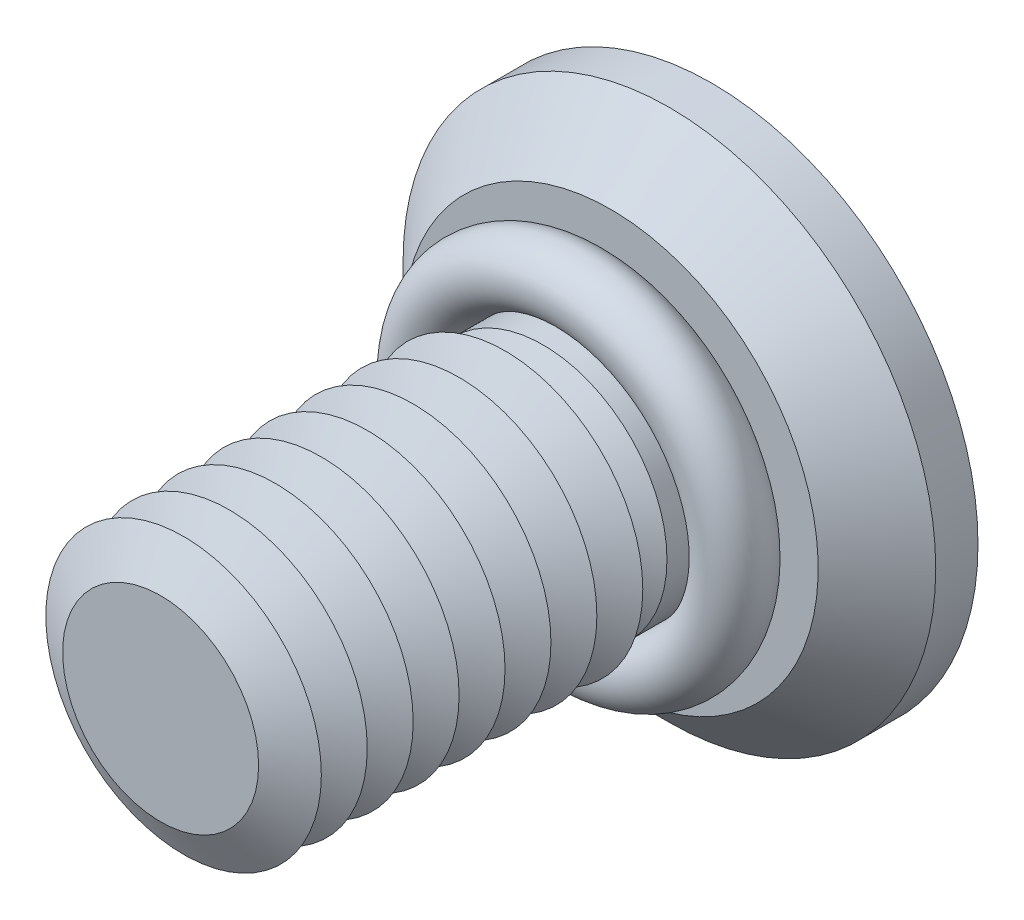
ISO-10303-21;
HEADER;
FILE_DESCRIPTION(('STEP AP214'),'2;1');
FILE_NAME('part.step','',(''),(''),'','','');
FILE_SCHEMA(('AUTOMOTIVE_DESIGN { 1 0 10303 214 1 1 1 1 }'));
ENDSEC;
DATA;
#1=APPLICATION_CONTEXT('core data for automotive mechanical design processes');
#2=APPLICATION_PROTOCOL_DEFINITION('international standard','automotive_design',2000,#1);
#3=PRODUCT_CONTEXT('',#1,'mechanical');
#4=PRODUCT('Part','Part','',(#3));
#5=PRODUCT_RELATED_PRODUCT_CATEGORY('part','',(#4));
#6=PRODUCT_DEFINITION_FORMATION('','',#4);
#7=PRODUCT_DEFINITION_CONTEXT('part definition',#1,'design');
#8=PRODUCT_DEFINITION('design','',#6,#7);
#9=PRODUCT_DEFINITION_SHAPE('','',#8);
#10=(LENGTH_UNIT() NAMED_UNIT(*) SI_UNIT(.MILLI.,.METRE.));
#11=(NAMED_UNIT(*) PLANE_ANGLE_UNIT() SI_UNIT($,.RADIAN.));
#12=(NAMED_UNIT(*) SI_UNIT($,.STERADIAN.) SOLID_ANGLE_UNIT());
#13=UNCERTAINTY_MEASURE_WITH_UNIT(LENGTH_MEASURE(1.E-05),#10,'distance_accuracy_value','');
#14=(GEOMETRIC_REPRESENTATION_CONTEXT(3) GLOBAL_UNCERTAINTY_ASSIGNED_CONTEXT((#13)) GLOBAL_UNIT_ASSIGNED_CONTEXT((#10,
#11,#12)) REPRESENTATION_CONTEXT('',''));
#15=CARTESIAN_POINT('',(0.,0.,0.));
#16=DIRECTION('',(0.,0.,1.));
#17=DIRECTION('',(1.,0.,0.));
#18=AXIS2_PLACEMENT_3D('',#15,#16,#17);
#19=CARTESIAN_POINT('',(0.,0.,1.45000000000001));
#20=DIRECTION('',(0.,0.,1.));
#21=DIRECTION('',(1.,0.,0.));
#22=AXIS2_PLACEMENT_3D('',#19,#20,#21);
#23=TOROIDAL_SURFACE('',#22,1.7,0.35);
#24=CARTESIAN_POINT('',(0.,1.7,1.45000000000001));
#25=DIRECTION('',(1.,0.,0.));
#26=DIRECTION('',(0.,0.,-1.));
#27=AXIS2_PLACEMENT_3D('',#24,#25,#26);
#28=CIRCLE('',#27,0.35);
#29=CARTESIAN_POINT('',(0.,2.05,1.45000000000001));
#30=VERTEX_POINT('',#29);
#31=EDGE_CURVE('P0_E10',#30,#30,#28,.T.);
#32=CARTESIAN_POINT('',(0.,0.,1.45000000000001));
#33=DIRECTION('',(0.,0.,1.));
#34=DIRECTION('',(1.,0.,0.));
#35=AXIS2_PLACEMENT_3D('',#32,#33,#34);
#36=CIRCLE('',#35,2.05);
#37=EDGE_CURVE('',#30,#30,#36,.T.);
#38=ORIENTED_EDGE('',*,*,#31,.F.);
#39=ORIENTED_EDGE('',*,*,#31,.T.);
#40=ORIENTED_EDGE('',*,*,#37,.T.);
#41=ORIENTED_EDGE('',*,*,#37,.F.);
#42=EDGE_LOOP('',(#38,#40,#39,#41));
#43=FACE_BOUND('',#42,.T.);
#44=ADVANCED_FACE('P0_F14',(#43),#23,.T.);
#45=CLOSED_SHELL('',(#44));
#46=MANIFOLD_SOLID_BREP('P0_B1',#45);
#47=CARTESIAN_POINT('',(0.,0.,3.5));
#48=DIRECTION('',(0.,0.,-1.));
#49=DIRECTION('',(-1.,0.,0.));
#50=AXIS2_PLACEMENT_3D('',#47,#48,#49);
#51=CONICAL_SURFACE('',#50,1.06698729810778,1.0471975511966);
#52=CARTESIAN_POINT('',(0.,0.,3.25));
#53=DIRECTION('',(0.,0.,1.));
#54=DIRECTION('',(1.,0.,0.));
#55=AXIS2_PLACEMENT_3D('',#52,#53,#54);
#56=CIRCLE('',#55,1.5);
#57=CARTESIAN_POINT('',(1.5,0.,3.25));
#58=VERTEX_POINT('',#57);
#59=EDGE_CURVE('P1_E324',#58,#58,#56,.T.);
#60=ORIENTED_EDGE('',*,*,#59,.T.);
#61=EDGE_LOOP('',(#60));
#62=FACE_BOUND('',#61,.T.);
#63=CARTESIAN_POINT('',(0.,0.,3.5));
#64=DIRECTION('',(0.,0.,1.));
#65=DIRECTION('',(1.,0.,0.));
#66=AXIS2_PLACEMENT_3D('',#63,#64,#65);
#67=CIRCLE('',#66,1.06698729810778);
#68=CARTESIAN_POINT('',(1.06698729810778,0.,3.5));
#69=VERTEX_POINT('',#68);
#70=EDGE_CURVE('P1_E321',#69,#69,#67,.T.);
#71=ORIENTED_EDGE('',*,*,#70,.F.);
#72=EDGE_LOOP('',(#71));
#73=FACE_BOUND('',#72,.T.);
#74=ADVANCED_FACE('P1_F15',(#62,#73),#51,.T.);
#75=CARTESIAN_POINT('',(0.,0.,3.75));
#76=DIRECTION('',(0.,0.,1.));
#77=DIRECTION('',(1.,0.,0.));
#78=AXIS2_PLACEMENT_3D('',#75,#76,#77);
#79=CONICAL_SURFACE('',#78,1.5,1.0471975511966);
#80=ORIENTED_EDGE('',*,*,#70,.T.);
#81=EDGE_LOOP('',(#80));
#82=FACE_BOUND('',#81,.T.);
#83=CARTESIAN_POINT('',(0.,0.,3.75));
#84=DIRECTION('',(0.,0.,1.));
#85=DIRECTION('',(1.,0.,0.));
#86=AXIS2_PLACEMENT_3D('',#83,#84,#85);
#87=CIRCLE('',#86,1.5);
#88=CARTESIAN_POINT('',(1.5,0.,3.75));
#89=VERTEX_POINT('',#88);
#90=EDGE_CURVE('P1_E318',#89,#89,#87,.T.);
#91=ORIENTED_EDGE('',*,*,#90,.F.);
#92=EDGE_LOOP('',(#91));
#93=FACE_BOUND('',#92,.T.);
#94=ADVANCED_FACE('P1_F245',(#82,#93),#79,.T.);
#95=CARTESIAN_POINT('',(0.,0.,6.));
#96=DIRECTION('',(0.,0.,1.));
#97=DIRECTION('',(1.,0.,0.));
#98=AXIS2_PLACEMENT_3D('',#95,#96,#97);
#99=PLANE('',#98);
#100=CARTESIAN_POINT('',(0.,0.,6.));
#101=DIRECTION('',(0.,0.,1.));
#102=DIRECTION('',(1.,0.,0.));
#103=AXIS2_PLACEMENT_3D('',#100,#101,#102);
#104=CIRCLE('',#103,1.06698729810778);
#105=CARTESIAN_POINT('',(1.06698729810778,0.,6.));
#106=VERTEX_POINT('',#105);
#107=EDGE_CURVE('P1_E131',#106,#106,#104,.T.);
#108=ORIENTED_EDGE('',*,*,#107,.T.);
#109=EDGE_LOOP('',(#108));
#110=FACE_BOUND('',#109,.T.);
#111=ADVANCED_FACE('P1_F251',(#110),#99,.T.);
#112=CARTESIAN_POINT('',(0.,0.,6.));
#113=DIRECTION('',(0.,0.,-1.));
#114=DIRECTION('',(-1.,0.,0.));
#115=AXIS2_PLACEMENT_3D('',#112,#113,#114);
#116=CONICAL_SURFACE('',#115,1.06698729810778,1.0471975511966);
#117=CARTESIAN_POINT('',(0.,0.,5.75));
#118=DIRECTION('',(0.,0.,1.));
#119=DIRECTION('',(1.,0.,0.));
#120=AXIS2_PLACEMENT_3D('',#117,#118,#119);
#121=CIRCLE('',#120,1.5);
#122=CARTESIAN_POINT('',(1.5,0.,5.75));
#123=VERTEX_POINT('',#122);
#124=EDGE_CURVE('P1_E133',#123,#123,#121,.T.);
#125=ORIENTED_EDGE('',*,*,#124,.T.);
#126=EDGE_LOOP('',(#125));
#127=FACE_BOUND('',#126,.T.);
#128=ORIENTED_EDGE('',*,*,#107,.F.);
#129=EDGE_LOOP('',(#128));
#130=FACE_BOUND('',#129,.T.);
#131=ADVANCED_FACE('P1_F196',(#127,#130),#116,.T.);
#132=CARTESIAN_POINT('',(0.,0.,5.75));
#133=DIRECTION('',(0.,0.,1.));
#134=DIRECTION('',(1.,0.,0.));
#135=AXIS2_PLACEMENT_3D('',#132,#133,#134);
#136=CONICAL_SURFACE('',#135,1.5,1.0471975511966);
#137=CARTESIAN_POINT('',(0.,0.,5.5));
#138=DIRECTION('',(0.,0.,1.));
#139=DIRECTION('',(1.,0.,0.));
#140=AXIS2_PLACEMENT_3D('',#137,#138,#139);
#141=CIRCLE('',#140,1.06698729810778);
#142=CARTESIAN_POINT('',(1.06698729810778,0.,5.5));
#143=VERTEX_POINT('',#142);
#144=EDGE_CURVE('P1_E297',#143,#143,#141,.T.);
#145=ORIENTED_EDGE('',*,*,#144,.T.);
#146=EDGE_LOOP('',(#145));
#147=FACE_BOUND('',#146,.T.);
#148=ORIENTED_EDGE('',*,*,#124,.F.);
#149=EDGE_LOOP('',(#148));
#150=FACE_BOUND('',#149,.T.);
#151=ADVANCED_FACE('P1_F284',(#147,#150),#136,.T.);
#152=CARTESIAN_POINT('',(0.,0.,5.5));
#153=DIRECTION('',(0.,0.,-1.));
#154=DIRECTION('',(-1.,0.,0.));
#155=AXIS2_PLACEMENT_3D('',#152,#153,#154);
#156=CONICAL_SURFACE('',#155,1.06698729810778,1.0471975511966);
#157=CARTESIAN_POINT('',(0.,0.,5.25));
#158=DIRECTION('',(0.,0.,1.));
#159=DIRECTION('',(1.,0.,0.));
#160=AXIS2_PLACEMENT_3D('',#157,#158,#159);
#161=CIRCLE('',#160,1.5);
#162=CARTESIAN_POINT('',(1.5,0.,5.25));
#163=VERTEX_POINT('',#162);
#164=EDGE_CURVE('P1_E294',#163,#163,#161,.T.);
#165=ORIENTED_EDGE('',*,*,#164,.T.);
#166=EDGE_LOOP('',(#165));
#167=FACE_BOUND('',#166,.T.);
#168=ORIENTED_EDGE('',*,*,#144,.F.);
#169=EDGE_LOOP('',(#168));
#170=FACE_BOUND('',#169,.T.);
#171=ADVANCED_FACE('P1_F279',(#167,#170),#156,.T.);
#172=CARTESIAN_POINT('',(0.,0.,5.25));
#173=DIRECTION('',(0.,0.,1.));
#174=DIRECTION('',(1.,0.,0.));
#175=AXIS2_PLACEMENT_3D('',#172,#173,#174);
#176=CONICAL_SURFACE('',#175,1.5,1.0471975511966);
#177=CARTESIAN_POINT('',(0.,0.,5.));
#178=DIRECTION('',(0.,0.,1.));
#179=DIRECTION('',(1.,0.,0.));
#180=AXIS2_PLACEMENT_3D('',#177,#178,#179);
#181=CIRCLE('',#180,1.06698729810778);
#182=CARTESIAN_POINT('',(1.06698729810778,0.,5.));
#183=VERTEX_POINT('',#182);
#184=EDGE_CURVE('P1_E301',#183,#183,#181,.T.);
#185=ORIENTED_EDGE('',*,*,#184,.T.);
#186=EDGE_LOOP('',(#185));
#187=FACE_BOUND('',#186,.T.);
#188=ORIENTED_EDGE('',*,*,#164,.F.);
#189=EDGE_LOOP('',(#188));
#190=FACE_BOUND('',#189,.T.);
#191=ADVANCED_FACE('P1_F276',(#187,#190),#176,.T.);
#192=CARTESIAN_POINT('',(0.,0.,5.));
#193=DIRECTION('',(0.,0.,-1.));
#194=DIRECTION('',(-1.,0.,0.));
#195=AXIS2_PLACEMENT_3D('',#192,#193,#194);
#196=CONICAL_SURFACE('',#195,1.06698729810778,1.0471975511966);
#197=CARTESIAN_POINT('',(0.,0.,4.75));
#198=DIRECTION('',(0.,0.,1.));
#199=DIRECTION('',(1.,0.,0.));
#200=AXIS2_PLACEMENT_3D('',#197,#198,#199);
#201=CIRCLE('',#200,1.5);
#202=CARTESIAN_POINT('',(1.5,0.,4.75));
#203=VERTEX_POINT('',#202);
#204=EDGE_CURVE('P1_E306',#203,#203,#201,.T.);
#205=ORIENTED_EDGE('',*,*,#204,.T.);
#206=EDGE_LOOP('',(#205));
#207=FACE_BOUND('',#206,.T.);
#208=ORIENTED_EDGE('',*,*,#184,.F.);
#209=EDGE_LOOP('',(#208));
#210=FACE_BOUND('',#209,.T.);
#211=ADVANCED_FACE('P1_F271',(#207,#210),#196,.T.);
#212=CARTESIAN_POINT('',(0.,0.,4.75));
#213=DIRECTION('',(0.,0.,1.));
#214=DIRECTION('',(1.,0.,0.));
#215=AXIS2_PLACEMENT_3D('',#212,#213,#214);
#216=CONICAL_SURFACE('',#215,1.5,1.0471975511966);
#217=CARTESIAN_POINT('',(0.,0.,4.5));
#218=DIRECTION('',(0.,0.,1.));
#219=DIRECTION('',(1.,0.,0.));
#220=AXIS2_PLACEMENT_3D('',#217,#218,#219);
#221=CIRCLE('',#220,1.06698729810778);
#222=CARTESIAN_POINT('',(1.06698729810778,0.,4.5));
#223=VERTEX_POINT('',#222);
#224=EDGE_CURVE('P1_E309',#223,#223,#221,.T.);
#225=ORIENTED_EDGE('',*,*,#224,.T.);
#226=EDGE_LOOP('',(#225));
#227=FACE_BOUND('',#226,.T.);
#228=ORIENTED_EDGE('',*,*,#204,.F.);
#229=EDGE_LOOP('',(#228));
#230=FACE_BOUND('',#229,.T.);
#231=ADVANCED_FACE('P1_F268',(#227,#230),#216,.T.);
#232=CARTESIAN_POINT('',(0.,0.,4.5));
#233=DIRECTION('',(0.,0.,-1.));
#234=DIRECTION('',(-1.,0.,0.));
#235=AXIS2_PLACEMENT_3D('',#232,#233,#234);
#236=CONICAL_SURFACE('',#235,1.06698729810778,1.0471975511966);
#237=CARTESIAN_POINT('',(0.,0.,4.25));
#238=DIRECTION('',(0.,0.,1.));
#239=DIRECTION('',(1.,0.,0.));
#240=AXIS2_PLACEMENT_3D('',#237,#238,#239);
#241=CIRCLE('',#240,1.5);
#242=CARTESIAN_POINT('',(1.5,0.,4.25));
#243=VERTEX_POINT('',#242);
#244=EDGE_CURVE('P1_E312',#243,#243,#241,.T.);
#245=ORIENTED_EDGE('',*,*,#244,.T.);
#246=EDGE_LOOP('',(#245));
#247=FACE_BOUND('',#246,.T.);
#248=ORIENTED_EDGE('',*,*,#224,.F.);
#249=EDGE_LOOP('',(#248));
#250=FACE_BOUND('',#249,.T.);
#251=ADVANCED_FACE('P1_F262',(#247,#250),#236,.T.);
#252=CARTESIAN_POINT('',(0.,0.,4.25));
#253=DIRECTION('',(0.,0.,1.));
#254=DIRECTION('',(1.,0.,0.));
#255=AXIS2_PLACEMENT_3D('',#252,#253,#254);
#256=CONICAL_SURFACE('',#255,1.5,1.0471975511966);
#257=CARTESIAN_POINT('',(0.,0.,4.));
#258=DIRECTION('',(0.,0.,1.));
#259=DIRECTION('',(1.,0.,0.));
#260=AXIS2_PLACEMENT_3D('',#257,#258,#259);
#261=CIRCLE('',#260,1.06698729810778);
#262=CARTESIAN_POINT('',(1.06698729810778,0.,4.));
#263=VERTEX_POINT('',#262);
#264=EDGE_CURVE('P1_E315',#263,#263,#261,.T.);
#265=ORIENTED_EDGE('',*,*,#264,.T.);
#266=EDGE_LOOP('',(#265));
#267=FACE_BOUND('',#266,.T.);
#268=ORIENTED_EDGE('',*,*,#244,.F.);
#269=EDGE_LOOP('',(#268));
#270=FACE_BOUND('',#269,.T.);
#271=ADVANCED_FACE('P1_F258',(#267,#270),#256,.T.);
#272=CARTESIAN_POINT('',(0.,0.,4.));
#273=DIRECTION('',(0.,0.,-1.));
#274=DIRECTION('',(-1.,0.,0.));
#275=AXIS2_PLACEMENT_3D('',#272,#273,#274);
#276=CONICAL_SURFACE('',#275,1.06698729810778,1.0471975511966);
#277=ORIENTED_EDGE('',*,*,#90,.T.);
#278=EDGE_LOOP('',(#277));
#279=FACE_BOUND('',#278,.T.);
#280=ORIENTED_EDGE('',*,*,#264,.F.);
#281=EDGE_LOOP('',(#280));
#282=FACE_BOUND('',#281,.T.);
#283=ADVANCED_FACE('P1_F261',(#279,#282),#276,.T.);
#284=CARTESIAN_POINT('',(0.,0.,3.));
#285=DIRECTION('',(0.,0.,-1.));
#286=DIRECTION('',(-1.,0.,0.));
#287=AXIS2_PLACEMENT_3D('',#284,#285,#286);
#288=CONICAL_SURFACE('',#287,1.06698729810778,1.0471975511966);
#289=CARTESIAN_POINT('',(0.,0.,2.75));
#290=DIRECTION('',(0.,0.,1.));
#291=DIRECTION('',(1.,0.,0.));
#292=AXIS2_PLACEMENT_3D('',#289,#290,#291);
#293=CIRCLE('',#292,1.5);
#294=CARTESIAN_POINT('',(1.5,0.,2.75));
#295=VERTEX_POINT('',#294);
#296=EDGE_CURVE('P1_E329',#295,#295,#293,.T.);
#297=ORIENTED_EDGE('',*,*,#296,.T.);
#298=EDGE_LOOP('',(#297));
#299=FACE_BOUND('',#298,.T.);
#300=CARTESIAN_POINT('',(0.,0.,3.));
#301=DIRECTION('',(0.,0.,1.));
#302=DIRECTION('',(1.,0.,0.));
#303=AXIS2_PLACEMENT_3D('',#300,#301,#302);
#304=CIRCLE('',#303,1.06698729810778);
#305=CARTESIAN_POINT('',(1.06698729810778,0.,3.));
#306=VERTEX_POINT('',#305);
#307=EDGE_CURVE('P1_E326',#306,#306,#304,.T.);
#308=ORIENTED_EDGE('',*,*,#307,.F.);
#309=EDGE_LOOP('',(#308));
#310=FACE_BOUND('',#309,.T.);
#311=ADVANCED_FACE('P1_F266',(#299,#310),#288,.T.);
#312=CARTESIAN_POINT('',(0.,0.,3.25));
#313=DIRECTION('',(0.,0.,1.));
#314=DIRECTION('',(1.,0.,0.));
#315=AXIS2_PLACEMENT_3D('',#312,#313,#314);
#316=CONICAL_SURFACE('',#315,1.5,1.0471975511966);
#317=ORIENTED_EDGE('',*,*,#307,.T.);
#318=EDGE_LOOP('',(#317));
#319=FACE_BOUND('',#318,.T.);
#320=ORIENTED_EDGE('',*,*,#59,.F.);
#321=EDGE_LOOP('',(#320));
#322=FACE_BOUND('',#321,.T.);
#323=ADVANCED_FACE('P1_F443',(#319,#322),#316,.T.);
#324=CARTESIAN_POINT('',(0.,0.,2.5));
#325=DIRECTION('',(0.,0.,-1.));
#326=DIRECTION('',(-1.,0.,0.));
#327=AXIS2_PLACEMENT_3D('',#324,#325,#326);
#328=CONICAL_SURFACE('',#327,1.06698729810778,1.0471975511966);
#329=CARTESIAN_POINT('',(0.,0.,2.25));
#330=DIRECTION('',(0.,0.,1.));
#331=DIRECTION('',(1.,0.,0.));
#332=AXIS2_PLACEMENT_3D('',#329,#330,#331);
#333=CIRCLE('',#332,1.5);
#334=CARTESIAN_POINT('',(1.5,0.,2.25));
#335=VERTEX_POINT('',#334);
#336=EDGE_CURVE('P1_E335',#335,#335,#333,.T.);
#337=ORIENTED_EDGE('',*,*,#336,.T.);
#338=EDGE_LOOP('',(#337));
#339=FACE_BOUND('',#338,.T.);
#340=CARTESIAN_POINT('',(0.,0.,2.5));
#341=DIRECTION('',(0.,0.,1.));
#342=DIRECTION('',(1.,0.,0.));
#343=AXIS2_PLACEMENT_3D('',#340,#341,#342);
#344=CIRCLE('',#343,1.06698729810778);
#345=CARTESIAN_POINT('',(1.06698729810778,0.,2.5));
#346=VERTEX_POINT('',#345);
#347=EDGE_CURVE('P1_E332',#346,#346,#344,.T.);
#348=ORIENTED_EDGE('',*,*,#347,.F.);
#349=EDGE_LOOP('',(#348));
#350=FACE_BOUND('',#349,.T.);
#351=ADVANCED_FACE('P1_F453',(#339,#350),#328,.T.);
#352=CARTESIAN_POINT('',(0.,0.,2.75));
#353=DIRECTION('',(0.,0.,1.));
#354=DIRECTION('',(1.,0.,0.));
#355=AXIS2_PLACEMENT_3D('',#352,#353,#354);
#356=CONICAL_SURFACE('',#355,1.5,1.0471975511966);
#357=ORIENTED_EDGE('',*,*,#347,.T.);
#358=EDGE_LOOP('',(#357));
#359=FACE_BOUND('',#358,.T.);
#360=ORIENTED_EDGE('',*,*,#296,.F.);
#361=EDGE_LOOP('',(#360));
#362=FACE_BOUND('',#361,.T.);
#363=ADVANCED_FACE('P1_F348',(#359,#362),#356,.T.);
#364=CARTESIAN_POINT('',(0.,0.,2.));
#365=DIRECTION('',(0.,0.,-1.));
#366=DIRECTION('',(-1.,0.,0.));
#367=AXIS2_PLACEMENT_3D('',#364,#365,#366);
#368=CONICAL_SURFACE('',#367,1.06698729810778,1.0471975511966);
#369=CARTESIAN_POINT('',(0.,0.,2.));
#370=DIRECTION('',(0.,0.,1.));
#371=DIRECTION('',(1.,0.,0.));
#372=AXIS2_PLACEMENT_3D('',#369,#370,#371);
#373=CIRCLE('',#372,1.06698729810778);
#374=CARTESIAN_POINT('',(1.06698729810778,0.,2.));
#375=VERTEX_POINT('',#374);
#376=EDGE_CURVE('P1_E338',#375,#375,#373,.T.);
#377=ORIENTED_EDGE('',*,*,#376,.F.);
#378=EDGE_LOOP('',(#377));
#379=FACE_BOUND('',#378,.T.);
#380=CARTESIAN_POINT('',(0.,0.,1.83660254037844));
#381=DIRECTION('',(0.,0.,-1.));
#382=DIRECTION('',(-1.,0.,0.));
#383=AXIS2_PLACEMENT_3D('',#380,#381,#382);
#384=CIRCLE('',#383,1.35);
#385=CARTESIAN_POINT('',(-1.35,0.,1.83660254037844));
#386=VERTEX_POINT('',#385);
#387=EDGE_CURVE('P1_E19',#386,#386,#384,.F.);
#388=ORIENTED_EDGE('',*,*,#387,.T.);
#389=EDGE_LOOP('',(#388));
#390=FACE_BOUND('',#389,.T.);
#391=ADVANCED_FACE('P1_F345',(#379,#390),#368,.T.);
#392=CARTESIAN_POINT('',(0.,0.,2.25));
#393=DIRECTION('',(0.,0.,1.));
#394=DIRECTION('',(1.,0.,0.));
#395=AXIS2_PLACEMENT_3D('',#392,#393,#394);
#396=CONICAL_SURFACE('',#395,1.5,1.0471975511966);
#397=ORIENTED_EDGE('',*,*,#376,.T.);
#398=EDGE_LOOP('',(#397));
#399=FACE_BOUND('',#398,.T.);
#400=ORIENTED_EDGE('',*,*,#336,.F.);
#401=EDGE_LOOP('',(#400));
#402=FACE_BOUND('',#401,.T.);
#403=ADVANCED_FACE('P1_F342',(#399,#402),#396,.T.);
#404=CARTESIAN_POINT('',(0.,0.,1.2));
#405=DIRECTION('',(0.,0.,-1.));
#406=DIRECTION('',(-1.,0.,0.));
#407=AXIS2_PLACEMENT_3D('',#404,#405,#406);
#408=CONICAL_SURFACE('',#407,1.,1.0471975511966);
#409=CARTESIAN_POINT('',(0.,0.,1.77735026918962));
#410=VERTEX_POINT('',#409);
#411=VERTEX_LOOP('',#410);
#412=FACE_BOUND('',#411,.T.);
#413=CARTESIAN_POINT('',(0.,0.,1.2));
#414=DIRECTION('',(0.,0.,-1.));
#415=DIRECTION('',(-1.,0.,0.));
#416=AXIS2_PLACEMENT_3D('',#413,#414,#415);
#417=CIRCLE('',#416,1.);
#418=CARTESIAN_POINT('',(-1.,0.,1.2));
#419=VERTEX_POINT('',#418);
#420=CARTESIAN_POINT('',(-0.5,0.866025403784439,1.2));
#421=VERTEX_POINT('',#420);
#422=EDGE_CURVE('P1_E117',#419,#421,#417,.T.);
#423=ORIENTED_EDGE('',*,*,#422,.T.);
#424=CARTESIAN_POINT('',(0.,0.,1.2));
#425=DIRECTION('',(0.,0.,-1.));
#426=DIRECTION('',(-1.,0.,0.));
#427=AXIS2_PLACEMENT_3D('',#424,#425,#426);
#428=CIRCLE('',#427,1.);
#429=CARTESIAN_POINT('',(0.5,0.866025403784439,1.2));
#430=VERTEX_POINT('',#429);
#431=EDGE_CURVE('P1_E24',#421,#430,#428,.T.);
#432=ORIENTED_EDGE('',*,*,#431,.T.);
#433=CARTESIAN_POINT('',(1.,0.,1.2));
#434=VERTEX_POINT('',#433);
#435=EDGE_CURVE('P1_E687',#430,#434,#428,.T.);
#436=ORIENTED_EDGE('',*,*,#435,.T.);
#437=CARTESIAN_POINT('',(0.5,-0.866025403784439,1.2));
#438=VERTEX_POINT('',#437);
#439=EDGE_CURVE('P1_E680',#434,#438,#428,.T.);
#440=ORIENTED_EDGE('',*,*,#439,.T.);
#441=CARTESIAN_POINT('',(-0.499999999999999,-0.866025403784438,1.2));
#442=VERTEX_POINT('',#441);
#443=EDGE_CURVE('P1_E182',#438,#442,#428,.T.);
#444=ORIENTED_EDGE('',*,*,#443,.T.);
#445=EDGE_CURVE('P1_E179',#442,#419,#428,.T.);
#446=ORIENTED_EDGE('',*,*,#445,.T.);
#447=EDGE_LOOP('',(#423,#432,#436,#440,#444,#446));
#448=FACE_BOUND('',#447,.T.);
#449=ADVANCED_FACE('P1_F198',(#412,#448),#408,.F.);
#450=CARTESIAN_POINT('',(0.,0.,1.2));
#451=DIRECTION('',(0.,0.,-1.));
#452=DIRECTION('',(-1.,0.,0.));
#453=AXIS2_PLACEMENT_3D('',#450,#451,#452);
#454=PLANE('',#453);
#455=ORIENTED_EDGE('',*,*,#443,.F.);
#456=DIRECTION('',(-0.866025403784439,-0.5,0.));
#457=VECTOR('',#456,1.);
#458=CARTESIAN_POINT('',(1.,-0.577350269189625,1.2));
#459=LINE('',#458,#457);
#460=CARTESIAN_POINT('',(0.,-1.15470053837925,1.2));
#461=VERTEX_POINT('',#460);
#462=EDGE_CURVE('P1_E696',#438,#461,#459,.T.);
#463=ORIENTED_EDGE('',*,*,#462,.T.);
#464=DIRECTION('',(-0.866025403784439,0.5,0.));
#465=VECTOR('',#464,1.);
#466=CARTESIAN_POINT('',(0.,-1.15470053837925,1.2));
#467=LINE('',#466,#465);
#468=EDGE_CURVE('P1_E703',#461,#442,#467,.T.);
#469=ORIENTED_EDGE('',*,*,#468,.T.);
#470=EDGE_LOOP('',(#455,#463,#469));
#471=FACE_BOUND('',#470,.T.);
#472=ADVANCED_FACE('P1_F496',(#471),#454,.T.);
#473=ORIENTED_EDGE('',*,*,#445,.F.);
#474=CARTESIAN_POINT('',(-1.,-0.577350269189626,1.2));
#475=VERTEX_POINT('',#474);
#476=EDGE_CURVE('P1_E706',#442,#475,#467,.T.);
#477=ORIENTED_EDGE('',*,*,#476,.T.);
#478=DIRECTION('',(0.,1.,0.));
#479=VECTOR('',#478,1.);
#480=CARTESIAN_POINT('',(-1.,-0.577350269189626,1.2));
#481=LINE('',#480,#479);
#482=EDGE_CURVE('P1_E123',#475,#419,#481,.T.);
#483=ORIENTED_EDGE('',*,*,#482,.T.);
#484=EDGE_LOOP('',(#473,#477,#483));
#485=FACE_BOUND('',#484,.T.);
#486=ADVANCED_FACE('P1_F231',(#485),#454,.T.);
#487=ORIENTED_EDGE('',*,*,#422,.F.);
#488=CARTESIAN_POINT('',(-0.999999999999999,0.577350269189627,1.2));
#489=VERTEX_POINT('',#488);
#490=EDGE_CURVE('P1_E708',#419,#489,#481,.T.);
#491=ORIENTED_EDGE('',*,*,#490,.T.);
#492=DIRECTION('',(0.866025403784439,0.5,0.));
#493=VECTOR('',#492,1.);
#494=CARTESIAN_POINT('',(-0.999999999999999,0.577350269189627,1.2));
#495=LINE('',#494,#493);
#496=EDGE_CURVE('P1_E711',#489,#421,#495,.T.);
#497=ORIENTED_EDGE('',*,*,#496,.T.);
#498=EDGE_LOOP('',(#487,#491,#497));
#499=FACE_BOUND('',#498,.T.);
#500=ADVANCED_FACE('P1_F514',(#499),#454,.T.);
#501=ORIENTED_EDGE('',*,*,#431,.F.);
#502=CARTESIAN_POINT('',(0.,1.15470053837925,1.2));
#503=VERTEX_POINT('',#502);
#504=EDGE_CURVE('P1_E710',#421,#503,#495,.T.);
#505=ORIENTED_EDGE('',*,*,#504,.T.);
#506=DIRECTION('',(0.866025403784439,-0.5,0.));
#507=VECTOR('',#506,1.);
#508=CARTESIAN_POINT('',(0.,1.15470053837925,1.2));
#509=LINE('',#508,#507);
#510=EDGE_CURVE('P1_E161',#503,#430,#509,.T.);
#511=ORIENTED_EDGE('',*,*,#510,.T.);
#512=EDGE_LOOP('',(#501,#505,#511));
#513=FACE_BOUND('',#512,.T.);
#514=ADVANCED_FACE('P1_F522',(#513),#454,.T.);
#515=ORIENTED_EDGE('',*,*,#435,.F.);
#516=CARTESIAN_POINT('',(1.,0.577350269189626,1.2));
#517=VERTEX_POINT('',#516);
#518=EDGE_CURVE('P1_E695',#430,#517,#509,.T.);
#519=ORIENTED_EDGE('',*,*,#518,.T.);
#520=DIRECTION('',(0.,-1.,0.));
#521=VECTOR('',#520,1.);
#522=CARTESIAN_POINT('',(1.,0.577350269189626,1.2));
#523=LINE('',#522,#521);
#524=EDGE_CURVE('P1_E690',#517,#434,#523,.T.);
#525=ORIENTED_EDGE('',*,*,#524,.T.);
#526=EDGE_LOOP('',(#515,#519,#525));
#527=FACE_BOUND('',#526,.T.);
#528=ADVANCED_FACE('P1_F531',(#527),#454,.T.);
#529=ORIENTED_EDGE('',*,*,#439,.F.);
#530=CARTESIAN_POINT('',(1.,-0.577350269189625,1.2));
#531=VERTEX_POINT('',#530);
#532=EDGE_CURVE('P1_E682',#434,#531,#523,.T.);
#533=ORIENTED_EDGE('',*,*,#532,.T.);
#534=EDGE_CURVE('P1_E125',#531,#438,#459,.T.);
#535=ORIENTED_EDGE('',*,*,#534,.T.);
#536=EDGE_LOOP('',(#529,#533,#535));
#537=FACE_BOUND('',#536,.T.);
#538=ADVANCED_FACE('P1_F229',(#537),#454,.T.);
#539=CARTESIAN_POINT('',(1.,-0.577350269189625,1.2));
#540=DIRECTION('',(0.5,-0.866025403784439,0.));
#541=DIRECTION('',(0.866025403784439,0.5,0.));
#542=AXIS2_PLACEMENT_3D('',#539,#540,#541);
#543=PLANE('',#542);
#544=DIRECTION('',(0.,0.,-1.));
#545=VECTOR('',#544,1.);
#546=CARTESIAN_POINT('',(1.,-0.577350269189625,1.2));
#547=LINE('',#546,#545);
#548=CARTESIAN_POINT('',(1.,-0.577350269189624,0.));
#549=VERTEX_POINT('',#548);
#550=EDGE_CURVE('P1_E164',#531,#549,#547,.T.);
#551=ORIENTED_EDGE('',*,*,#550,.T.);
#552=CARTESIAN_POINT('',(1.0002,-0.577234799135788,-3.09447482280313E-05));
#553=CARTESIAN_POINT('',(0.958655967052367,-0.601220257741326,0.00640029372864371));
#554=CARTESIAN_POINT('',(0.917036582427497,-0.625249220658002,0.0122389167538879));
#555=CARTESIAN_POINT('',(0.833650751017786,-0.673392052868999,0.022496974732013));
#556=CARTESIAN_POINT('',(0.79188425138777,-0.697505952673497,0.0269158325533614));
#557=CARTESIAN_POINT('',(0.70845756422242,-0.745672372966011,0.0340762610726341));
#558=CARTESIAN_POINT('',(0.666797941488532,-0.769724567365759,0.036826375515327));
#559=CARTESIAN_POINT('',(0.583425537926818,-0.817859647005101,0.0405140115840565));
#560=CARTESIAN_POINT('',(0.541712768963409,-0.84194252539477,0.0414518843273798));
#561=CARTESIAN_POINT('',(0.458287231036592,-0.890108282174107,0.0414518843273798));
#562=CARTESIAN_POINT('',(0.416574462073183,-0.914191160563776,0.0405140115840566));
#563=CARTESIAN_POINT('',(0.333202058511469,-0.962326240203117,0.0368263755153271));
#564=CARTESIAN_POINT('',(0.291542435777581,-0.986378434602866,0.0340762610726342));
#565=CARTESIAN_POINT('',(0.208115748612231,-1.03454485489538,0.0269158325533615));
#566=CARTESIAN_POINT('',(0.166349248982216,-1.05865875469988,0.0224969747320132));
#567=CARTESIAN_POINT('',(0.0829634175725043,-1.10680158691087,0.012238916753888));
#568=CARTESIAN_POINT('',(0.0413440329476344,-1.13083054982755,0.00640029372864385));
#569=CARTESIAN_POINT('',(-0.000199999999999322,-1.15481600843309,-3.09447482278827E-05));
#570=B_SPLINE_CURVE_WITH_KNOTS('',3,(#552,#553,#554,#555,#556,#557,#558,#559,#560,#561,#562,
#563,#564,#565,#566,#567,#568,#569),.UNSPECIFIED.,.F.,.F.,(4,2,2,2,2,2,2,2,4),(0.,
0.145207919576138,0.290474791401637,0.434991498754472,0.579480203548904,0.723968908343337,
0.868485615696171,1.01375248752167,1.15896040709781),.UNSPECIFIED.);
#571=CARTESIAN_POINT('',(0.,-1.15470053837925,0.));
#572=VERTEX_POINT('',#571);
#573=EDGE_CURVE('P1_E118',#549,#572,#570,.T.);
#574=ORIENTED_EDGE('',*,*,#573,.T.);
#575=DIRECTION('',(0.,0.,-1.));
#576=VECTOR('',#575,1.);
#577=CARTESIAN_POINT('',(0.,-1.15470053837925,1.2));
#578=LINE('',#577,#576);
#579=EDGE_CURVE('P1_E116',#461,#572,#578,.T.);
#580=ORIENTED_EDGE('',*,*,#579,.F.);
#581=ORIENTED_EDGE('',*,*,#462,.F.);
#582=ORIENTED_EDGE('',*,*,#534,.F.);
#583=EDGE_LOOP('',(#551,#574,#580,#581,#582));
#584=FACE_BOUND('',#583,.T.);
#585=ADVANCED_FACE('P1_F226',(#584),#543,.F.);
#586=CARTESIAN_POINT('',(0.,-1.15470053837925,1.2));
#587=DIRECTION('',(-0.5,-0.866025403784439,0.));
#588=DIRECTION('',(0.866025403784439,-0.5,0.));
#589=AXIS2_PLACEMENT_3D('',#586,#587,#588);
#590=PLANE('',#589);
#591=ORIENTED_EDGE('',*,*,#579,.T.);
#592=CARTESIAN_POINT('',(0.000200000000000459,-1.15481600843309,-3.09447482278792E-05));
#593=CARTESIAN_POINT('',(-0.0413440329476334,-1.13083054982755,0.00640029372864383));
#594=CARTESIAN_POINT('',(-0.0829634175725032,-1.10680158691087,0.012238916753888));
#595=CARTESIAN_POINT('',(-0.166349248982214,-1.05865875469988,0.0224969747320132));
#596=CARTESIAN_POINT('',(-0.20811574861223,-1.03454485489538,0.0269158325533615));
#597=CARTESIAN_POINT('',(-0.29154243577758,-0.986378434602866,0.0340762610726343));
#598=CARTESIAN_POINT('',(-0.333202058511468,-0.962326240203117,0.0368263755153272));
#599=CARTESIAN_POINT('',(-0.416574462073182,-0.914191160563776,0.0405140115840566));
#600=CARTESIAN_POINT('',(-0.458287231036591,-0.890108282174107,0.0414518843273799));
#601=CARTESIAN_POINT('',(-0.541712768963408,-0.84194252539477,0.0414518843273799));
#602=CARTESIAN_POINT('',(-0.583425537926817,-0.817859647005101,0.0405140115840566));
#603=CARTESIAN_POINT('',(-0.666797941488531,-0.76972456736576,0.0368263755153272));
#604=CARTESIAN_POINT('',(-0.708457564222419,-0.745672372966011,0.0340762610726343));
#605=CARTESIAN_POINT('',(-0.791884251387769,-0.697505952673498,0.0269158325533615));
#606=CARTESIAN_POINT('',(-0.833650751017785,-0.673392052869,0.0224969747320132));
#607=CARTESIAN_POINT('',(-0.917036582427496,-0.625249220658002,0.012238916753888));
#608=CARTESIAN_POINT('',(-0.958655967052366,-0.601220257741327,0.00640029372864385));
#609=CARTESIAN_POINT('',(-1.0002,-0.577234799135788,-3.09447482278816E-05));
#610=B_SPLINE_CURVE_WITH_KNOTS('',3,(#592,#593,#594,#595,#596,#597,#598,#599,#600,#601,#602,
#603,#604,#605,#606,#607,#608,#609),.UNSPECIFIED.,.F.,.F.,(4,2,2,2,2,2,2,2,4),(0.,
0.145207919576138,0.290474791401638,0.434991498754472,0.579480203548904,0.723968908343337,
0.868485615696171,1.01375248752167,1.15896040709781),.UNSPECIFIED.);
#611=CARTESIAN_POINT('',(-1.,-0.577350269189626,0.));
#612=VERTEX_POINT('',#611);
#613=EDGE_CURVE('P1_E94',#572,#612,#610,.T.);
#614=ORIENTED_EDGE('',*,*,#613,.T.);
#615=DIRECTION('',(0.,0.,-1.));
#616=VECTOR('',#615,1.);
#617=CARTESIAN_POINT('',(-1.,-0.577350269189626,1.2));
#618=LINE('',#617,#616);
#619=EDGE_CURVE('P1_E112',#475,#612,#618,.T.);
#620=ORIENTED_EDGE('',*,*,#619,.F.);
#621=ORIENTED_EDGE('',*,*,#476,.F.);
#622=ORIENTED_EDGE('',*,*,#468,.F.);
#623=EDGE_LOOP('',(#591,#614,#620,#621,#622));
#624=FACE_BOUND('',#623,.T.);
#625=ADVANCED_FACE('P1_F110',(#624),#590,.F.);
#626=CARTESIAN_POINT('',(-1.,-0.577350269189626,1.2));
#627=DIRECTION('',(-1.,0.,0.));
#628=DIRECTION('',(0.,-1.,0.));
#629=AXIS2_PLACEMENT_3D('',#626,#627,#628);
#630=PLANE('',#629);
#631=ORIENTED_EDGE('',*,*,#619,.T.);
#632=CARTESIAN_POINT('',(-1.,-1.50720379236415,-0.175258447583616));
#633=CARTESIAN_POINT('',(-1.,-1.46204888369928,-0.165178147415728));
#634=CARTESIAN_POINT('',(-1.,-1.41686530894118,-0.155226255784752));
#635=CARTESIAN_POINT('',(-1.,-1.3264264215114,-0.135644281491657));
#636=CARTESIAN_POINT('',(-1.,-1.28117110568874,-0.126014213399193));
#637=CARTESIAN_POINT('',(-1.,-1.14519006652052,-0.0976864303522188));
#638=CARTESIAN_POINT('',(-1.,-1.05434091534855,-0.0795718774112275));
#639=CARTESIAN_POINT('',(-1.,-0.872985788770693,-0.0458587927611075));
#640=CARTESIAN_POINT('',(-1.,-0.782483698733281,-0.0302397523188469));
#641=CARTESIAN_POINT('',(-1.,-0.600935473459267,-0.00256781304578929));
#642=CARTESIAN_POINT('',(-1.,-0.509889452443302,0.00948580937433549));
#643=CARTESIAN_POINT('',(-1.,-0.326198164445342,0.0284754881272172));
#644=CARTESIAN_POINT('',(-1.,-0.233546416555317,0.0353525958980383));
#645=CARTESIAN_POINT('',(-1.,-0.0480110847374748,0.0422668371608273));
#646=CARTESIAN_POINT('',(-0.999999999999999,0.0448723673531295,0.0423072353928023));
#647=CARTESIAN_POINT('',(-0.999999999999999,0.230753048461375,0.0355315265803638));
#648=CARTESIAN_POINT('',(-0.999999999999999,0.323749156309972,0.0286870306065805));
#649=CARTESIAN_POINT('',(-0.999999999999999,0.509217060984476,0.00959637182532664));
#650=CARTESIAN_POINT('',(-0.999999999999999,0.601688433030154,-0.00265366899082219));
#651=CARTESIAN_POINT('',(-0.999999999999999,0.788469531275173,-0.0311825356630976));
#652=CARTESIAN_POINT('',(-0.999999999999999,0.882763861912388,-0.0475586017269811));
#653=CARTESIAN_POINT('',(-0.999999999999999,1.0708947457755,-0.082785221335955));
#654=CARTESIAN_POINT('',(-0.999999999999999,1.16473122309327,-0.101636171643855));
#655=CARTESIAN_POINT('',(-0.999999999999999,1.35209202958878,-0.140942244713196));
#656=CARTESIAN_POINT('',(-0.999999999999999,1.44561626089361,-0.16139782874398));
#657=CARTESIAN_POINT('',(-0.999999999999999,1.63242626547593,-0.203372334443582));
#658=CARTESIAN_POINT('',(-0.999999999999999,1.72571203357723,-0.224891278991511));
#659=CARTESIAN_POINT('',(-0.999999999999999,1.9109739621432,-0.26839206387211));
#660=CARTESIAN_POINT('',(-0.999999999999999,2.00295221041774,-0.290365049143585));
#661=CARTESIAN_POINT('',(-0.999999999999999,2.18678775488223,-0.334819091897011));
#662=CARTESIAN_POINT('',(-0.999999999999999,2.27864504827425,-0.35730016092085));
#663=CARTESIAN_POINT('',(-0.999999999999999,2.46214009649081,-0.402600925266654));
#664=CARTESIAN_POINT('',(-0.999999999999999,2.55377797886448,-0.425420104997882));
#665=CARTESIAN_POINT('',(-0.999999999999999,2.73697957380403,-0.471340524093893));
#666=CARTESIAN_POINT('',(-0.999999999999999,2.82854328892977,-0.494441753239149));
#667=CARTESIAN_POINT('',(-0.999999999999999,2.9200818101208,-0.517641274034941));
#668=B_SPLINE_CURVE_WITH_KNOTS('',3,(#632,#633,#634,#635,#636,#637,#638,#639,#640,#641,#642,
#643,#644,#645,#646,#647,#648,#649,#650,#651,#652,#653,#654,#655,#656,#657,#658,#659,#660,#661,
#662,#663,#664,#665,#666,#667),.UNSPECIFIED.,.F.,.F.,(4,2,2,2,2,2,2,2,2,2,2,2,2,2,2,2,2,4),(0.,
0.138798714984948,0.277603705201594,0.555495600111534,0.830971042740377,1.10639054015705,
1.38490086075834,1.66327818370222,1.94280808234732,2.22253884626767,2.50960639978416,
2.79672003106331,3.08391650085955,3.37111915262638,3.65481652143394,3.93852034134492,
4.22182877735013,4.50512697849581),.UNSPECIFIED.);
#669=CARTESIAN_POINT('',(-1.,0.577350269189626,0.));
#670=VERTEX_POINT('',#669);
#671=EDGE_CURVE('P1_E10',#612,#670,#668,.T.);
#672=ORIENTED_EDGE('',*,*,#671,.T.);
#673=DIRECTION('',(0.,0.,-1.));
#674=VECTOR('',#673,1.);
#675=CARTESIAN_POINT('',(-0.999999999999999,0.577350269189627,1.2));
#676=LINE('',#675,#674);
#677=EDGE_CURVE('P1_E124',#489,#670,#676,.T.);
#678=ORIENTED_EDGE('',*,*,#677,.F.);
#679=ORIENTED_EDGE('',*,*,#490,.F.);
#680=ORIENTED_EDGE('',*,*,#482,.F.);
#681=EDGE_LOOP('',(#631,#672,#678,#679,#680));
#682=FACE_BOUND('',#681,.T.);
#683=ADVANCED_FACE('P1_F120',(#682),#630,.F.);
#684=CARTESIAN_POINT('',(-0.999999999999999,0.577350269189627,1.2));
#685=DIRECTION('',(-0.5,0.866025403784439,0.));
#686=DIRECTION('',(-0.866025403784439,-0.5,0.));
#687=AXIS2_PLACEMENT_3D('',#684,#685,#686);
#688=PLANE('',#687);
#689=ORIENTED_EDGE('',*,*,#677,.T.);
#690=CARTESIAN_POINT('',(-1.0002,0.577234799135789,-3.09447482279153E-05));
#691=CARTESIAN_POINT('',(-0.958655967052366,0.601220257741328,0.0064002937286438));
#692=CARTESIAN_POINT('',(-0.917036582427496,0.625249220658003,0.0122389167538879));
#693=CARTESIAN_POINT('',(-0.833650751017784,0.673392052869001,0.0224969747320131));
#694=CARTESIAN_POINT('',(-0.791884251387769,0.697505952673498,0.0269158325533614));
#695=CARTESIAN_POINT('',(-0.708457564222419,0.745672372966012,0.0340762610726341));
#696=CARTESIAN_POINT('',(-0.666797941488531,0.76972456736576,0.036826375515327));
#697=CARTESIAN_POINT('',(-0.583425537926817,0.817859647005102,0.0405140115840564));
#698=CARTESIAN_POINT('',(-0.541712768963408,0.841942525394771,0.0414518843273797));
#699=CARTESIAN_POINT('',(-0.458287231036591,0.890108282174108,0.0414518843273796));
#700=CARTESIAN_POINT('',(-0.416574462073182,0.914191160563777,0.0405140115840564));
#701=CARTESIAN_POINT('',(-0.333202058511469,0.962326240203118,0.0368263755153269));
#702=CARTESIAN_POINT('',(-0.291542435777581,0.986378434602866,0.0340762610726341));
#703=CARTESIAN_POINT('',(-0.208115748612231,1.03454485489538,0.0269158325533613));
#704=CARTESIAN_POINT('',(-0.166349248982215,1.05865875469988,0.0224969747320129));
#705=CARTESIAN_POINT('',(-0.0829634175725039,1.10680158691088,0.0122389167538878));
#706=CARTESIAN_POINT('',(-0.041344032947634,1.13083054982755,0.00640029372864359));
#707=CARTESIAN_POINT('',(0.0001999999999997,1.15481600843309,-3.09447482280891E-05));
#708=B_SPLINE_CURVE_WITH_KNOTS('',3,(#690,#691,#692,#693,#694,#695,#696,#697,#698,#699,#700,
#701,#702,#703,#704,#705,#706,#707),.UNSPECIFIED.,.F.,.F.,(4,2,2,2,2,2,2,2,4),(0.,
0.145207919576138,0.290474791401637,0.434991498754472,0.579480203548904,0.723968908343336,
0.868485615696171,1.01375248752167,1.15896040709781),.UNSPECIFIED.);
#709=CARTESIAN_POINT('',(0.,1.15470053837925,0.));
#710=VERTEX_POINT('',#709);
#711=EDGE_CURVE('P1_E136',#670,#710,#708,.T.);
#712=ORIENTED_EDGE('',*,*,#711,.T.);
#713=DIRECTION('',(0.,0.,-1.));
#714=VECTOR('',#713,1.);
#715=CARTESIAN_POINT('',(0.,1.15470053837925,1.2));
#716=LINE('',#715,#714);
#717=EDGE_CURVE('P1_E155',#503,#710,#716,.T.);
#718=ORIENTED_EDGE('',*,*,#717,.F.);
#719=ORIENTED_EDGE('',*,*,#504,.F.);
#720=ORIENTED_EDGE('',*,*,#496,.F.);
#721=EDGE_LOOP('',(#689,#712,#718,#719,#720));
#722=FACE_BOUND('',#721,.T.);
#723=ADVANCED_FACE('P1_F153',(#722),#688,.F.);
#724=CARTESIAN_POINT('',(0.,1.15470053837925,1.2));
#725=DIRECTION('',(0.5,0.866025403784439,0.));
#726=DIRECTION('',(-0.866025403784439,0.5,0.));
#727=AXIS2_PLACEMENT_3D('',#724,#725,#726);
#728=PLANE('',#727);
#729=ORIENTED_EDGE('',*,*,#717,.T.);
#730=CARTESIAN_POINT('',(-0.000199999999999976,1.15481600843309,-3.09447482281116E-05));
#731=CARTESIAN_POINT('',(0.0413440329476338,1.13083054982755,0.00640029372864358));
#732=CARTESIAN_POINT('',(0.0829634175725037,1.10680158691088,0.0122389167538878));
#733=CARTESIAN_POINT('',(0.166349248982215,1.05865875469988,0.0224969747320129));
#734=CARTESIAN_POINT('',(0.208115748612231,1.03454485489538,0.0269158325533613));
#735=CARTESIAN_POINT('',(0.291542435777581,0.986378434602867,0.034076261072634));
#736=CARTESIAN_POINT('',(0.333202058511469,0.962326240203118,0.0368263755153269));
#737=CARTESIAN_POINT('',(0.416574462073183,0.914191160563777,0.0405140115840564));
#738=CARTESIAN_POINT('',(0.458287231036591,0.890108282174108,0.0414518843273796));
#739=CARTESIAN_POINT('',(0.541712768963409,0.841942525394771,0.0414518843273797));
#740=CARTESIAN_POINT('',(0.583425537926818,0.817859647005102,0.0405140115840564));
#741=CARTESIAN_POINT('',(0.666797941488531,0.769724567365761,0.0368263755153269));
#742=CARTESIAN_POINT('',(0.708457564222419,0.745672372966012,0.034076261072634));
#743=CARTESIAN_POINT('',(0.791884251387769,0.697505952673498,0.0269158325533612));
#744=CARTESIAN_POINT('',(0.833650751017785,0.673392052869,0.0224969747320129));
#745=CARTESIAN_POINT('',(0.917036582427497,0.625249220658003,0.0122389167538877));
#746=CARTESIAN_POINT('',(0.958655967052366,0.601220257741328,0.00640029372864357));
#747=CARTESIAN_POINT('',(1.0002,0.577234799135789,-3.09447482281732E-05));
#748=B_SPLINE_CURVE_WITH_KNOTS('',3,(#730,#731,#732,#733,#734,#735,#736,#737,#738,#739,#740,
#741,#742,#743,#744,#745,#746,#747),.UNSPECIFIED.,.F.,.F.,(4,2,2,2,2,2,2,2,4),(0.,
0.145207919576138,0.290474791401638,0.434991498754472,0.579480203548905,0.723968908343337,
0.868485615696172,1.01375248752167,1.15896040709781),.UNSPECIFIED.);
#749=CARTESIAN_POINT('',(1.,0.577350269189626,0.));
#750=VERTEX_POINT('',#749);
#751=EDGE_CURVE('P1_E141',#710,#750,#748,.T.);
#752=ORIENTED_EDGE('',*,*,#751,.T.);
#753=DIRECTION('',(0.,0.,-1.));
#754=VECTOR('',#753,1.);
#755=CARTESIAN_POINT('',(1.,0.577350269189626,1.2));
#756=LINE('',#755,#754);
#757=EDGE_CURVE('P1_E162',#517,#750,#756,.T.);
#758=ORIENTED_EDGE('',*,*,#757,.F.);
#759=ORIENTED_EDGE('',*,*,#518,.F.);
#760=ORIENTED_EDGE('',*,*,#510,.F.);
#761=EDGE_LOOP('',(#729,#752,#758,#759,#760));
#762=FACE_BOUND('',#761,.T.);
#763=ADVANCED_FACE('P1_F158',(#762),#728,.F.);
#764=CARTESIAN_POINT('',(1.,0.577350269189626,1.2));
#765=DIRECTION('',(1.,0.,0.));
#766=DIRECTION('',(0.,0.,-1.));
#767=AXIS2_PLACEMENT_3D('',#764,#765,#766);
#768=PLANE('',#767);
#769=ORIENTED_EDGE('',*,*,#757,.T.);
#770=CARTESIAN_POINT('',(1.,-1.50720379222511,-0.175258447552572));
#771=CARTESIAN_POINT('',(1.,-1.46204888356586,-0.165178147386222));
#772=CARTESIAN_POINT('',(1.,-1.41686530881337,-0.155226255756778));
#773=CARTESIAN_POINT('',(1.,-1.32642642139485,-0.135644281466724));
#774=CARTESIAN_POINT('',(1.,-1.28117110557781,-0.126014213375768));
#775=CARTESIAN_POINT('',(1.,-1.14519006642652,-0.0976864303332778));
#776=CARTESIAN_POINT('',(1.,-1.05434091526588,-0.07957187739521));
#777=CARTESIAN_POINT('',(1.,-0.872985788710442,-0.0458587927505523));
#778=CARTESIAN_POINT('',(1.,-0.78248369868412,-0.0302397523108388));
#779=CARTESIAN_POINT('',(1.,-0.600935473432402,-0.00256781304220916));
#780=CARTESIAN_POINT('',(1.,-0.509889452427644,0.00948580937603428));
#781=CARTESIAN_POINT('',(1.,-0.326198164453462,0.0284754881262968));
#782=CARTESIAN_POINT('',(1.,-0.233546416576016,0.0353525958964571));
#783=CARTESIAN_POINT('',(1.,-0.0480110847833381,0.0422668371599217));
#784=CARTESIAN_POINT('',(1.,0.044872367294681,0.0423072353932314));
#785=CARTESIAN_POINT('',(1.,0.230753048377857,0.0355315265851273));
#786=CARTESIAN_POINT('',(1.,0.323749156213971,0.0286870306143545));
#787=CARTESIAN_POINT('',(1.,0.50921706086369,0.00959637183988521));
#788=CARTESIAN_POINT('',(1.,0.601688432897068,-0.0026536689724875));
#789=CARTESIAN_POINT('',(1.,0.788469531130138,-0.0311825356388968));
#790=CARTESIAN_POINT('',(1.,0.882763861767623,-0.0475586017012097));
#791=CARTESIAN_POINT('',(1.,1.07089474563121,-0.0827852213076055));
#792=CARTESIAN_POINT('',(1.,1.16473122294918,-0.101636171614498));
#793=CARTESIAN_POINT('',(1.,1.35209202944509,-0.140942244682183));
#794=CARTESIAN_POINT('',(1.,1.44561626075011,-0.16139782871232));
#795=CARTESIAN_POINT('',(1.,1.63242626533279,-0.203372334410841));
#796=CARTESIAN_POINT('',(1.,1.72571203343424,-0.224891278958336));
#797=CARTESIAN_POINT('',(1.,1.91097396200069,-0.268392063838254));
#798=CARTESIAN_POINT('',(1.,2.00295221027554,-0.290365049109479));
#799=CARTESIAN_POINT('',(1.,2.18678775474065,-0.334819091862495));
#800=CARTESIAN_POINT('',(1.,2.27864504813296,-0.357300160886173));
#801=CARTESIAN_POINT('',(1.,2.46214009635,-0.402600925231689));
#802=CARTESIAN_POINT('',(1.,2.55377797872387,-0.42542010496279));
#803=CARTESIAN_POINT('',(1.,2.73697957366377,-0.471340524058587));
#804=CARTESIAN_POINT('',(1.,2.82854328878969,-0.494441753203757));
#805=CARTESIAN_POINT('',(1.,2.92008180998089,-0.517641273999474));
#806=B_SPLINE_CURVE_WITH_KNOTS('',3,(#770,#771,#772,#773,#774,#775,#776,#777,#778,#779,#780,
#781,#782,#783,#784,#785,#786,#787,#788,#789,#790,#791,#792,#793,#794,#795,#796,#797,#798,#799,
#800,#801,#802,#803,#804,#805),.UNSPECIFIED.,.F.,.F.,(4,2,2,2,2,2,2,2,2,2,2,2,2,2,2,2,2,4),(0.,
0.138798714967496,0.277603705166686,0.555495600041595,0.830971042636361,1.106390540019,
1.38490086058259,1.66327818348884,1.94280808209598,2.22253884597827,2.50960639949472,
2.79672003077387,3.08391650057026,3.37111915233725,3.65481652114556,3.93852034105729,
4.22182877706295,4.50512697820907),.UNSPECIFIED.);
#807=EDGE_CURVE('P1_E149',#750,#549,#806,.F.);
#808=ORIENTED_EDGE('',*,*,#807,.T.);
#809=ORIENTED_EDGE('',*,*,#550,.F.);
#810=ORIENTED_EDGE('',*,*,#532,.F.);
#811=ORIENTED_EDGE('',*,*,#524,.F.);
#812=EDGE_LOOP('',(#769,#808,#809,#810,#811));
#813=FACE_BOUND('',#812,.T.);
#814=ADVANCED_FACE('P1_F232',(#813),#768,.F.);
#815=CARTESIAN_POINT('',(0.,0.,0.));
#816=DIRECTION('',(0.,0.,-1.));
#817=DIRECTION('',(-1.,0.,0.));
#818=AXIS2_PLACEMENT_3D('',#815,#816,#817);
#819=CONICAL_SURFACE('',#818,1.15470053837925,1.30899693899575);
#820=CARTESIAN_POINT('',(0.,0.,0.));
#821=DIRECTION('',(0.,0.,-1.));
#822=DIRECTION('',(-1.,0.,0.));
#823=AXIS2_PLACEMENT_3D('',#820,#821,#822);
#824=CIRCLE('',#823,1.15470053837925);
#825=EDGE_CURVE('P1_E30',#549,#572,#824,.T.);
#826=ORIENTED_EDGE('',*,*,#825,.T.);
#827=ORIENTED_EDGE('',*,*,#573,.F.);
#828=EDGE_LOOP('',(#826,#827));
#829=FACE_BOUND('',#828,.T.);
#830=ADVANCED_FACE('P1_F195',(#829),#819,.F.);
#831=EDGE_CURVE('P1_E90',#572,#612,#824,.T.);
#832=ORIENTED_EDGE('',*,*,#831,.T.);
#833=ORIENTED_EDGE('',*,*,#613,.F.);
#834=EDGE_LOOP('',(#832,#833));
#835=FACE_BOUND('',#834,.T.);
#836=ADVANCED_FACE('P1_F92',(#835),#819,.F.);
#837=EDGE_CURVE('P1_E98',#612,#670,#824,.T.);
#838=ORIENTED_EDGE('',*,*,#837,.T.);
#839=ORIENTED_EDGE('',*,*,#671,.F.);
#840=EDGE_LOOP('',(#838,#839));
#841=FACE_BOUND('',#840,.T.);
#842=ADVANCED_FACE('P1_F102',(#841),#819,.F.);
#843=EDGE_CURVE('P1_E130',#670,#710,#824,.T.);
#844=ORIENTED_EDGE('',*,*,#843,.T.);
#845=ORIENTED_EDGE('',*,*,#711,.F.);
#846=EDGE_LOOP('',(#844,#845));
#847=FACE_BOUND('',#846,.T.);
#848=ADVANCED_FACE('P1_F604',(#847),#819,.F.);
#849=EDGE_CURVE('P1_E137',#710,#750,#824,.T.);
#850=ORIENTED_EDGE('',*,*,#849,.T.);
#851=ORIENTED_EDGE('',*,*,#751,.F.);
#852=EDGE_LOOP('',(#850,#851));
#853=FACE_BOUND('',#852,.T.);
#854=ADVANCED_FACE('P1_F144',(#853),#819,.F.);
#855=EDGE_CURVE('P1_E37',#750,#549,#824,.T.);
#856=ORIENTED_EDGE('',*,*,#855,.T.);
#857=ORIENTED_EDGE('',*,*,#807,.F.);
#858=EDGE_LOOP('',(#856,#857));
#859=FACE_BOUND('',#858,.T.);
#860=ADVANCED_FACE('P1_F590',(#859),#819,.F.);
#861=CARTESIAN_POINT('',(0.,0.,0.));
#862=DIRECTION('',(0.,0.,1.));
#863=DIRECTION('',(1.,0.,0.));
#864=AXIS2_PLACEMENT_3D('',#861,#862,#863);
#865=PLANE('',#864);
#866=ORIENTED_EDGE('',*,*,#855,.F.);
#867=ORIENTED_EDGE('',*,*,#849,.F.);
#868=ORIENTED_EDGE('',*,*,#843,.F.);
#869=ORIENTED_EDGE('',*,*,#837,.F.);
#870=ORIENTED_EDGE('',*,*,#831,.F.);
#871=ORIENTED_EDGE('',*,*,#825,.F.);
#872=EDGE_LOOP('',(#866,#867,#868,#869,#870,#871));
#873=FACE_BOUND('',#872,.T.);
#874=CARTESIAN_POINT('',(0.,0.,0.));
#875=DIRECTION('',(0.,0.,-1.));
#876=DIRECTION('',(-1.,0.,0.));
#877=AXIS2_PLACEMENT_3D('',#874,#875,#876);
#878=CIRCLE('',#877,2.9);
#879=CARTESIAN_POINT('',(-2.9,0.,0.));
#880=VERTEX_POINT('',#879);
#881=EDGE_CURVE('P1_E169',#880,#880,#878,.T.);
#882=ORIENTED_EDGE('',*,*,#881,.T.);
#883=EDGE_LOOP('',(#882));
#884=FACE_BOUND('',#883,.T.);
#885=ADVANCED_FACE('P1_F17',(#873,#884),#865,.F.);
#886=CARTESIAN_POINT('',(0.,0.,6.));
#887=DIRECTION('',(0.,0.,-1.));
#888=DIRECTION('',(-1.,0.,0.));
#889=AXIS2_PLACEMENT_3D('',#886,#887,#888);
#890=CYLINDRICAL_SURFACE('',#889,2.9);
#891=ORIENTED_EDGE('',*,*,#881,.F.);
#892=EDGE_LOOP('',(#891));
#893=FACE_BOUND('',#892,.T.);
#894=CARTESIAN_POINT('',(0.,0.,0.46));
#895=DIRECTION('',(0.,0.,-1.));
#896=DIRECTION('',(-1.,0.,0.));
#897=AXIS2_PLACEMENT_3D('',#894,#895,#896);
#898=CIRCLE('',#897,2.9);
#899=CARTESIAN_POINT('',(-2.9,0.,0.46));
#900=VERTEX_POINT('',#899);
#901=EDGE_CURVE('P1_E172',#900,#900,#898,.T.);
#902=ORIENTED_EDGE('',*,*,#901,.T.);
#903=EDGE_LOOP('',(#902));
#904=FACE_BOUND('',#903,.T.);
#905=ADVANCED_FACE('P1_F366',(#893,#904),#890,.T.);
#906=CARTESIAN_POINT('',(0.,0.,0.));
#907=DIRECTION('',(0.,0.,-1.));
#908=DIRECTION('',(-1.,0.,0.));
#909=AXIS2_PLACEMENT_3D('',#906,#907,#908);
#910=CONICAL_SURFACE('',#909,3.36,0.785398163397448);
#911=CARTESIAN_POINT('',(0.,0.,1.1));
#912=DIRECTION('',(0.,0.,-1.));
#913=DIRECTION('',(-1.,0.,0.));
#914=AXIS2_PLACEMENT_3D('',#911,#912,#913);
#915=CIRCLE('',#914,2.26);
#916=CARTESIAN_POINT('',(-2.26,0.,1.1));
#917=VERTEX_POINT('',#916);
#918=EDGE_CURVE('P1_E176',#917,#917,#915,.T.);
#919=ORIENTED_EDGE('',*,*,#918,.T.);
#920=EDGE_LOOP('',(#919));
#921=FACE_BOUND('',#920,.T.);
#922=ORIENTED_EDGE('',*,*,#901,.F.);
#923=EDGE_LOOP('',(#922));
#924=FACE_BOUND('',#923,.T.);
#925=ADVANCED_FACE('P1_F361',(#921,#924),#910,.T.);
#926=CARTESIAN_POINT('',(0.,1.35,1.1));
#927=DIRECTION('',(0.,0.,-1.));
#928=DIRECTION('',(-1.,0.,0.));
#929=AXIS2_PLACEMENT_3D('',#926,#927,#928);
#930=PLANE('',#929);
#931=CARTESIAN_POINT('',(0.,0.,1.1));
#932=DIRECTION('',(0.,0.,-1.));
#933=DIRECTION('',(-1.,0.,0.));
#934=AXIS2_PLACEMENT_3D('',#931,#932,#933);
#935=CIRCLE('',#934,1.35);
#936=CARTESIAN_POINT('',(-1.35,0.,1.1));
#937=VERTEX_POINT('',#936);
#938=EDGE_CURVE('P1_E173',#937,#937,#935,.T.);
#939=ORIENTED_EDGE('',*,*,#938,.T.);
#940=EDGE_LOOP('',(#939));
#941=FACE_BOUND('',#940,.T.);
#942=ORIENTED_EDGE('',*,*,#918,.F.);
#943=EDGE_LOOP('',(#942));
#944=FACE_BOUND('',#943,.T.);
#945=ADVANCED_FACE('P1_F355',(#941,#944),#930,.F.);
#946=CARTESIAN_POINT('',(0.,0.,0.));
#947=DIRECTION('',(0.,0.,-1.));
#948=DIRECTION('',(-1.,0.,0.));
#949=AXIS2_PLACEMENT_3D('',#946,#947,#948);
#950=CYLINDRICAL_SURFACE('',#949,1.35);
#951=ORIENTED_EDGE('',*,*,#938,.F.);
#952=EDGE_LOOP('',(#951));
#953=FACE_BOUND('',#952,.T.);
#954=ORIENTED_EDGE('',*,*,#387,.F.);
#955=EDGE_LOOP('',(#954));
#956=FACE_BOUND('',#955,.T.);
#957=ADVANCED_FACE('P1_F353',(#953,#956),#950,.T.);
#958=CLOSED_SHELL('',(#74,#94,#111,#131,#151,#171,#191,#211,#231,#251,#271,#283,#311,#323,#351,
#363,#391,#403,#449,#472,#486,#500,#514,#528,#538,#585,#625,#683,#723,#763,#814,#830,#836,#842,
#848,#854,#860,#885,#905,#925,#945,#957));
#959=MANIFOLD_SOLID_BREP('P1_B1',#958);
#960=ADVANCED_BREP_SHAPE_REPRESENTATION('',(#18,#46,#959),#14);
#961=SHAPE_DEFINITION_REPRESENTATION(#9,#960);
ENDSEC;
END-ISO-10303-21;
